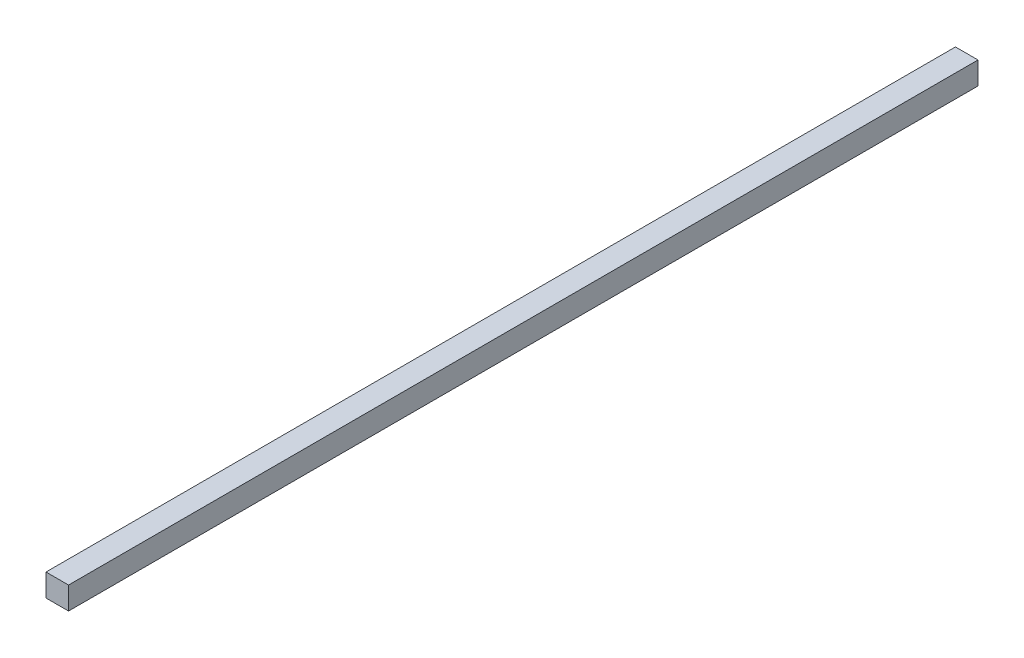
from build123d import *

# Parameters (mm, degrees)
SKETCH1_W      = 12.7
SKETCH1_H      = 12.7
EXTRUDE1_DEPTH = 512.318


with BuildPart() as part:
    # Sketch1 → Extrude1 (new body)
    with BuildSketch(Plane.XY):
        with Locations((6.35, 6.35)):
            Rectangle(SKETCH1_W, SKETCH1_H)
    extrude(amount=EXTRUDE1_DEPTH)


solid = part.part
